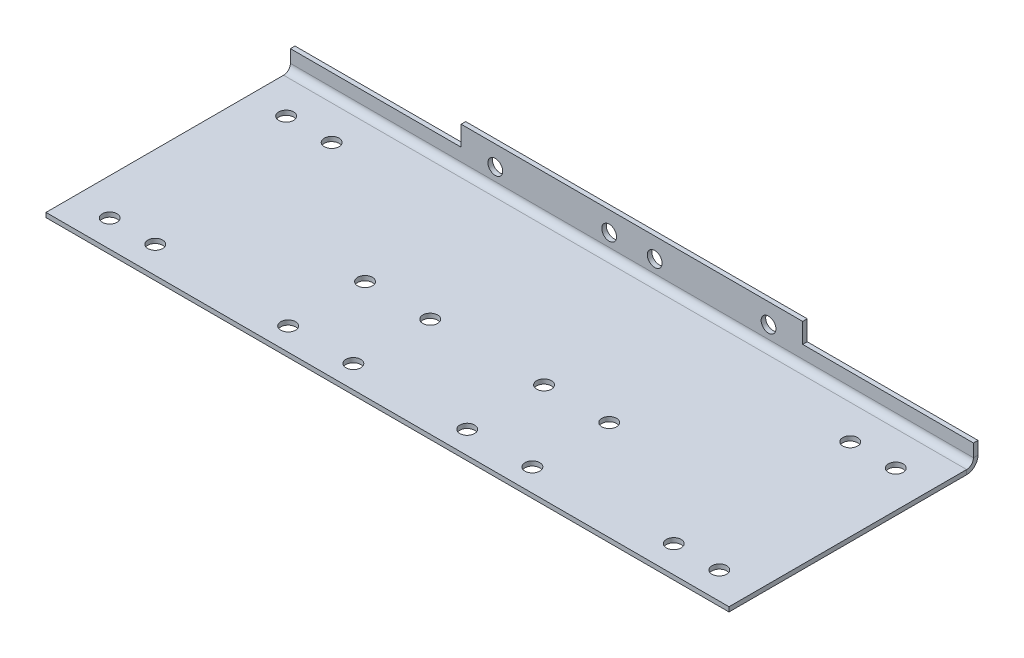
ISO-10303-21;
HEADER;
FILE_DESCRIPTION(('STEP AP214'),'2;1');
FILE_NAME('part.step','',(''),(''),'','','');
FILE_SCHEMA(('AUTOMOTIVE_DESIGN { 1 0 10303 214 1 1 1 1 }'));
ENDSEC;
DATA;
#1=APPLICATION_CONTEXT('core data for automotive mechanical design processes');
#2=APPLICATION_PROTOCOL_DEFINITION('international standard','automotive_design',2000,#1);
#3=PRODUCT_CONTEXT('',#1,'mechanical');
#4=PRODUCT('Part','Part','',(#3));
#5=PRODUCT_RELATED_PRODUCT_CATEGORY('part','',(#4));
#6=PRODUCT_DEFINITION_FORMATION('','',#4);
#7=PRODUCT_DEFINITION_CONTEXT('part definition',#1,'design');
#8=PRODUCT_DEFINITION('design','',#6,#7);
#9=PRODUCT_DEFINITION_SHAPE('','',#8);
#10=(LENGTH_UNIT() NAMED_UNIT(*) SI_UNIT(.MILLI.,.METRE.));
#11=(NAMED_UNIT(*) PLANE_ANGLE_UNIT() SI_UNIT($,.RADIAN.));
#12=(NAMED_UNIT(*) SI_UNIT($,.STERADIAN.) SOLID_ANGLE_UNIT());
#13=UNCERTAINTY_MEASURE_WITH_UNIT(LENGTH_MEASURE(1.E-05),#10,'distance_accuracy_value','');
#14=(GEOMETRIC_REPRESENTATION_CONTEXT(3) GLOBAL_UNCERTAINTY_ASSIGNED_CONTEXT((#13)) GLOBAL_UNIT_ASSIGNED_CONTEXT((#10,
#11,#12)) REPRESENTATION_CONTEXT('',''));
#15=CARTESIAN_POINT('',(0.,0.,0.));
#16=DIRECTION('',(0.,0.,1.));
#17=DIRECTION('',(1.,0.,0.));
#18=AXIS2_PLACEMENT_3D('',#15,#16,#17);
#19=CARTESIAN_POINT('',(0.,430.56637061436,429.433629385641));
#20=DIRECTION('',(0.,1.,0.));
#21=DIRECTION('',(1.,0.,0.));
#22=AXIS2_PLACEMENT_3D('',#19,#20,#21);
#23=PLANE('',#22);
#24=CARTESIAN_POINT('',(-500.000000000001,430.56637061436,254.433629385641));
#25=DIRECTION('',(0.,1.,0.));
#26=DIRECTION('',(0.,0.,1.));
#27=AXIS2_PLACEMENT_3D('',#24,#25,#26);
#28=CIRCLE('',#27,13.);
#29=CARTESIAN_POINT('',(-500.000000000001,430.56637061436,267.433629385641));
#30=VERTEX_POINT('',#29);
#31=EDGE_CURVE('E302',#30,#30,#28,.F.);
#32=ORIENTED_EDGE('',*,*,#31,.T.);
#33=EDGE_LOOP('',(#32));
#34=FACE_BOUND('',#33,.T.);
#35=CARTESIAN_POINT('',(-385.5,430.56637061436,254.43362938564));
#36=DIRECTION('',(0.,1.,0.));
#37=DIRECTION('',(0.,0.,1.));
#38=AXIS2_PLACEMENT_3D('',#35,#36,#37);
#39=CIRCLE('',#38,13.0000000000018);
#40=CARTESIAN_POINT('',(-385.5,430.56637061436,267.433629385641));
#41=VERTEX_POINT('',#40);
#42=EDGE_CURVE('E299',#41,#41,#39,.F.);
#43=ORIENTED_EDGE('',*,*,#42,.T.);
#44=EDGE_LOOP('',(#43));
#45=FACE_BOUND('',#44,.T.);
#46=CARTESIAN_POINT('',(-385.5,430.56637061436,389.43362938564));
#47=DIRECTION('',(0.,1.,0.));
#48=DIRECTION('',(0.,0.,1.));
#49=AXIS2_PLACEMENT_3D('',#46,#47,#48);
#50=CIRCLE('',#49,13.);
#51=CARTESIAN_POINT('',(-385.5,430.56637061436,402.43362938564));
#52=VERTEX_POINT('',#51);
#53=EDGE_CURVE('E296',#52,#52,#50,.F.);
#54=ORIENTED_EDGE('',*,*,#53,.T.);
#55=EDGE_LOOP('',(#54));
#56=FACE_BOUND('',#55,.T.);
#57=CARTESIAN_POINT('',(-500.,430.56637061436,389.433629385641));
#58=DIRECTION('',(0.,1.,0.));
#59=DIRECTION('',(0.,0.,1.));
#60=AXIS2_PLACEMENT_3D('',#57,#58,#59);
#61=CIRCLE('',#60,13.);
#62=CARTESIAN_POINT('',(-500.,430.56637061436,402.433629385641));
#63=VERTEX_POINT('',#62);
#64=EDGE_CURVE('E293',#63,#63,#61,.F.);
#65=ORIENTED_EDGE('',*,*,#64,.T.);
#66=EDGE_LOOP('',(#65));
#67=FACE_BOUND('',#66,.T.);
#68=CARTESIAN_POINT('',(-699.999999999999,430.56637061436,254.433629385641));
#69=DIRECTION('',(0.,1.,0.));
#70=DIRECTION('',(0.,0.,1.));
#71=AXIS2_PLACEMENT_3D('',#68,#69,#70);
#72=CIRCLE('',#71,13.);
#73=CARTESIAN_POINT('',(-699.999999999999,430.56637061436,267.433629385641));
#74=VERTEX_POINT('',#73);
#75=EDGE_CURVE('E326',#74,#74,#72,.T.);
#76=ORIENTED_EDGE('',*,*,#75,.F.);
#77=EDGE_LOOP('',(#76));
#78=FACE_BOUND('',#77,.T.);
#79=CARTESIAN_POINT('',(-814.5,430.56637061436,254.43362938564));
#80=DIRECTION('',(0.,1.,0.));
#81=DIRECTION('',(0.,0.,1.));
#82=AXIS2_PLACEMENT_3D('',#79,#80,#81);
#83=CIRCLE('',#82,13.0000000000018);
#84=CARTESIAN_POINT('',(-814.5,430.56637061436,267.433629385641));
#85=VERTEX_POINT('',#84);
#86=EDGE_CURVE('E323',#85,#85,#83,.T.);
#87=ORIENTED_EDGE('',*,*,#86,.F.);
#88=EDGE_LOOP('',(#87));
#89=FACE_BOUND('',#88,.T.);
#90=CARTESIAN_POINT('',(-814.5,430.56637061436,389.43362938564));
#91=DIRECTION('',(0.,1.,0.));
#92=DIRECTION('',(0.,0.,1.));
#93=AXIS2_PLACEMENT_3D('',#90,#91,#92);
#94=CIRCLE('',#93,13.);
#95=CARTESIAN_POINT('',(-814.5,430.56637061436,402.43362938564));
#96=VERTEX_POINT('',#95);
#97=EDGE_CURVE('E320',#96,#96,#94,.T.);
#98=ORIENTED_EDGE('',*,*,#97,.F.);
#99=EDGE_LOOP('',(#98));
#100=FACE_BOUND('',#99,.T.);
#101=CARTESIAN_POINT('',(-700.,430.56637061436,389.433629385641));
#102=DIRECTION('',(0.,1.,0.));
#103=DIRECTION('',(0.,0.,1.));
#104=AXIS2_PLACEMENT_3D('',#101,#102,#103);
#105=CIRCLE('',#104,13.);
#106=CARTESIAN_POINT('',(-700.,430.56637061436,402.433629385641));
#107=VERTEX_POINT('',#106);
#108=EDGE_CURVE('E317',#107,#107,#105,.T.);
#109=ORIENTED_EDGE('',*,*,#108,.F.);
#110=EDGE_LOOP('',(#109));
#111=FACE_BOUND('',#110,.T.);
#112=CARTESIAN_POINT('',(-64.4999999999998,430.566370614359,72.0000000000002));
#113=DIRECTION('',(0.,1.,0.));
#114=DIRECTION('',(0.,0.,1.));
#115=AXIS2_PLACEMENT_3D('',#112,#113,#114);
#116=CIRCLE('',#115,12.9999999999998);
#117=CARTESIAN_POINT('',(-64.4999999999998,430.566370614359,85.0000000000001));
#118=VERTEX_POINT('',#117);
#119=EDGE_CURVE('E366',#118,#118,#116,.F.);
#120=ORIENTED_EDGE('',*,*,#119,.T.);
#121=EDGE_LOOP('',(#120));
#122=FACE_BOUND('',#121,.T.);
#123=CARTESIAN_POINT('',(-64.4999999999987,430.56637061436,382.));
#124=DIRECTION('',(0.,1.,0.));
#125=DIRECTION('',(0.,0.,1.));
#126=AXIS2_PLACEMENT_3D('',#123,#124,#125);
#127=CIRCLE('',#126,12.9999999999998);
#128=CARTESIAN_POINT('',(-64.4999999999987,430.56637061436,395.));
#129=VERTEX_POINT('',#128);
#130=EDGE_CURVE('E360',#129,#129,#127,.F.);
#131=ORIENTED_EDGE('',*,*,#130,.T.);
#132=EDGE_LOOP('',(#131));
#133=FACE_BOUND('',#132,.T.);
#134=CARTESIAN_POINT('',(-1135.5,430.56637061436,382.));
#135=DIRECTION('',(0.,1.,0.));
#136=DIRECTION('',(0.,0.,1.));
#137=AXIS2_PLACEMENT_3D('',#134,#135,#136);
#138=CIRCLE('',#137,12.9999999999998);
#139=CARTESIAN_POINT('',(-1135.5,430.56637061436,395.));
#140=VERTEX_POINT('',#139);
#141=EDGE_CURVE('E357',#140,#140,#138,.T.);
#142=ORIENTED_EDGE('',*,*,#141,.F.);
#143=EDGE_LOOP('',(#142));
#144=FACE_BOUND('',#143,.T.);
#145=DIRECTION('',(0.,0.,-1.));
#146=VECTOR('',#145,1.);
#147=CARTESIAN_POINT('',(0.,430.56637061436,429.433629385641));
#148=LINE('',#147,#146);
#149=CARTESIAN_POINT('',(0.,430.56637061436,429.433629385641));
#150=VERTEX_POINT('',#149);
#151=CARTESIAN_POINT('',(0.,430.566370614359,12.));
#152=VERTEX_POINT('',#151);
#153=EDGE_CURVE('E71',#150,#152,#148,.T.);
#154=ORIENTED_EDGE('',*,*,#153,.T.);
#155=DIRECTION('',(-1.,0.,0.));
#156=VECTOR('',#155,1.);
#157=CARTESIAN_POINT('',(0.,430.566370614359,12.0000000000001));
#158=LINE('',#157,#156);
#159=CARTESIAN_POINT('',(-1200.,430.566370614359,12.));
#160=VERTEX_POINT('',#159);
#161=EDGE_CURVE('E63',#152,#160,#158,.T.);
#162=ORIENTED_EDGE('',*,*,#161,.T.);
#163=DIRECTION('',(0.,0.,1.));
#164=VECTOR('',#163,1.);
#165=CARTESIAN_POINT('',(-1200.,430.56637061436,429.433629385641));
#166=LINE('',#165,#164);
#167=CARTESIAN_POINT('',(-1200.,430.56637061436,429.433629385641));
#168=VERTEX_POINT('',#167);
#169=EDGE_CURVE('E78',#160,#168,#166,.T.);
#170=ORIENTED_EDGE('',*,*,#169,.T.);
#171=DIRECTION('',(1.,0.,0.));
#172=VECTOR('',#171,1.);
#173=CARTESIAN_POINT('',(0.,430.56637061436,429.433629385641));
#174=LINE('',#173,#172);
#175=EDGE_CURVE('E252',#168,#150,#174,.T.);
#176=ORIENTED_EDGE('',*,*,#175,.T.);
#177=EDGE_LOOP('',(#154,#162,#170,#176));
#178=FACE_BOUND('',#177,.T.);
#179=CARTESIAN_POINT('',(-144.5,430.566370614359,72.0000000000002));
#180=DIRECTION('',(0.,1.,0.));
#181=DIRECTION('',(0.,0.,1.));
#182=AXIS2_PLACEMENT_3D('',#179,#180,#181);
#183=CIRCLE('',#182,12.9999999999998);
#184=CARTESIAN_POINT('',(-144.5,430.566370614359,85.));
#185=VERTEX_POINT('',#184);
#186=EDGE_CURVE('E363',#185,#185,#183,.F.);
#187=ORIENTED_EDGE('',*,*,#186,.T.);
#188=EDGE_LOOP('',(#187));
#189=FACE_BOUND('',#188,.T.);
#190=CARTESIAN_POINT('',(-1055.5,430.56637061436,382.));
#191=DIRECTION('',(0.,1.,0.));
#192=DIRECTION('',(0.,0.,1.));
#193=AXIS2_PLACEMENT_3D('',#190,#191,#192);
#194=CIRCLE('',#193,12.9999999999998);
#195=CARTESIAN_POINT('',(-1055.5,430.56637061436,395.));
#196=VERTEX_POINT('',#195);
#197=EDGE_CURVE('E369',#196,#196,#194,.T.);
#198=ORIENTED_EDGE('',*,*,#197,.F.);
#199=EDGE_LOOP('',(#198));
#200=FACE_BOUND('',#199,.T.);
#201=CARTESIAN_POINT('',(-1055.5,430.566370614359,72.0000000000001));
#202=DIRECTION('',(0.,1.,0.));
#203=DIRECTION('',(0.,0.,1.));
#204=AXIS2_PLACEMENT_3D('',#201,#202,#203);
#205=CIRCLE('',#204,12.9999999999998);
#206=CARTESIAN_POINT('',(-1055.5,430.566370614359,84.9999999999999));
#207=VERTEX_POINT('',#206);
#208=EDGE_CURVE('E372',#207,#207,#205,.T.);
#209=ORIENTED_EDGE('',*,*,#208,.F.);
#210=EDGE_LOOP('',(#209));
#211=FACE_BOUND('',#210,.T.);
#212=CARTESIAN_POINT('',(-1135.5,430.566370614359,72.0000000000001));
#213=DIRECTION('',(0.,1.,0.));
#214=DIRECTION('',(0.,0.,1.));
#215=AXIS2_PLACEMENT_3D('',#212,#213,#214);
#216=CIRCLE('',#215,12.9999999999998);
#217=CARTESIAN_POINT('',(-1135.5,430.566370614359,84.9999999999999));
#218=VERTEX_POINT('',#217);
#219=EDGE_CURVE('E375',#218,#218,#216,.T.);
#220=ORIENTED_EDGE('',*,*,#219,.F.);
#221=EDGE_LOOP('',(#220));
#222=FACE_BOUND('',#221,.T.);
#223=CARTESIAN_POINT('',(-144.499999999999,430.56637061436,382.));
#224=DIRECTION('',(0.,1.,0.));
#225=DIRECTION('',(0.,0.,1.));
#226=AXIS2_PLACEMENT_3D('',#223,#224,#225);
#227=CIRCLE('',#226,12.9999999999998);
#228=CARTESIAN_POINT('',(-144.499999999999,430.56637061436,395.));
#229=VERTEX_POINT('',#228);
#230=EDGE_CURVE('E192',#229,#229,#227,.F.);
#231=ORIENTED_EDGE('',*,*,#230,.T.);
#232=EDGE_LOOP('',(#231));
#233=FACE_BOUND('',#232,.T.);
#234=ADVANCED_FACE('F54',(#34,#45,#56,#67,#78,#89,#100,#111,#122,#133,#144,#178,#189,#200,#211,
#222,#233),#23,.T.);
#235=CARTESIAN_POINT('',(0.,422.56637061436,429.433629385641));
#236=DIRECTION('',(0.,1.,0.));
#237=DIRECTION('',(1.,0.,0.));
#238=AXIS2_PLACEMENT_3D('',#235,#236,#237);
#239=PLANE('',#238);
#240=CARTESIAN_POINT('',(-500.000000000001,422.56637061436,254.433629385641));
#241=DIRECTION('',(0.,1.,0.));
#242=DIRECTION('',(0.,0.,-1.));
#243=AXIS2_PLACEMENT_3D('',#240,#241,#242);
#244=CIRCLE('',#243,13.);
#245=CARTESIAN_POINT('',(-500.000000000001,422.56637061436,241.433629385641));
#246=VERTEX_POINT('',#245);
#247=EDGE_CURVE('E273',#246,#246,#244,.T.);
#248=ORIENTED_EDGE('',*,*,#247,.T.);
#249=EDGE_LOOP('',(#248));
#250=FACE_BOUND('',#249,.T.);
#251=CARTESIAN_POINT('',(-385.5,422.56637061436,254.43362938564));
#252=DIRECTION('',(0.,1.,0.));
#253=DIRECTION('',(0.,0.,-1.));
#254=AXIS2_PLACEMENT_3D('',#251,#252,#253);
#255=CIRCLE('',#254,13.0000000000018);
#256=CARTESIAN_POINT('',(-385.5,422.56637061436,241.433629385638));
#257=VERTEX_POINT('',#256);
#258=EDGE_CURVE('E286',#257,#257,#255,.T.);
#259=ORIENTED_EDGE('',*,*,#258,.T.);
#260=EDGE_LOOP('',(#259));
#261=FACE_BOUND('',#260,.T.);
#262=CARTESIAN_POINT('',(-385.5,422.56637061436,389.43362938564));
#263=DIRECTION('',(0.,1.,0.));
#264=DIRECTION('',(0.,0.,-1.));
#265=AXIS2_PLACEMENT_3D('',#262,#263,#264);
#266=CIRCLE('',#265,13.);
#267=CARTESIAN_POINT('',(-385.5,422.56637061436,376.43362938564));
#268=VERTEX_POINT('',#267);
#269=EDGE_CURVE('E282',#268,#268,#266,.T.);
#270=ORIENTED_EDGE('',*,*,#269,.T.);
#271=EDGE_LOOP('',(#270));
#272=FACE_BOUND('',#271,.T.);
#273=CARTESIAN_POINT('',(-500.,422.56637061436,389.433629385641));
#274=DIRECTION('',(0.,1.,0.));
#275=DIRECTION('',(0.,0.,-1.));
#276=AXIS2_PLACEMENT_3D('',#273,#274,#275);
#277=CIRCLE('',#276,13.);
#278=CARTESIAN_POINT('',(-500.,422.56637061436,376.433629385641));
#279=VERTEX_POINT('',#278);
#280=EDGE_CURVE('E285',#279,#279,#277,.T.);
#281=ORIENTED_EDGE('',*,*,#280,.T.);
#282=EDGE_LOOP('',(#281));
#283=FACE_BOUND('',#282,.T.);
#284=CARTESIAN_POINT('',(-699.999999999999,422.56637061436,254.433629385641));
#285=DIRECTION('',(0.,-1.,0.));
#286=DIRECTION('',(0.,0.,-1.));
#287=AXIS2_PLACEMENT_3D('',#284,#285,#286);
#288=CIRCLE('',#287,13.);
#289=CARTESIAN_POINT('',(-699.999999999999,422.56637061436,241.433629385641));
#290=VERTEX_POINT('',#289);
#291=EDGE_CURVE('E305',#290,#290,#288,.T.);
#292=ORIENTED_EDGE('',*,*,#291,.F.);
#293=EDGE_LOOP('',(#292));
#294=FACE_BOUND('',#293,.T.);
#295=CARTESIAN_POINT('',(-814.5,422.56637061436,254.43362938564));
#296=DIRECTION('',(0.,-1.,0.));
#297=DIRECTION('',(0.,0.,-1.));
#298=AXIS2_PLACEMENT_3D('',#295,#296,#297);
#299=CIRCLE('',#298,13.0000000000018);
#300=CARTESIAN_POINT('',(-814.5,422.56637061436,241.433629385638));
#301=VERTEX_POINT('',#300);
#302=EDGE_CURVE('E310',#301,#301,#299,.T.);
#303=ORIENTED_EDGE('',*,*,#302,.F.);
#304=EDGE_LOOP('',(#303));
#305=FACE_BOUND('',#304,.T.);
#306=CARTESIAN_POINT('',(-814.5,422.56637061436,389.43362938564));
#307=DIRECTION('',(0.,-1.,0.));
#308=DIRECTION('',(0.,0.,-1.));
#309=AXIS2_PLACEMENT_3D('',#306,#307,#308);
#310=CIRCLE('',#309,13.);
#311=CARTESIAN_POINT('',(-814.5,422.56637061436,376.43362938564));
#312=VERTEX_POINT('',#311);
#313=EDGE_CURVE('E306',#312,#312,#310,.T.);
#314=ORIENTED_EDGE('',*,*,#313,.F.);
#315=EDGE_LOOP('',(#314));
#316=FACE_BOUND('',#315,.T.);
#317=CARTESIAN_POINT('',(-700.,422.56637061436,389.433629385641));
#318=DIRECTION('',(0.,-1.,0.));
#319=DIRECTION('',(0.,0.,-1.));
#320=AXIS2_PLACEMENT_3D('',#317,#318,#319);
#321=CIRCLE('',#320,13.);
#322=CARTESIAN_POINT('',(-700.,422.56637061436,376.433629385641));
#323=VERTEX_POINT('',#322);
#324=EDGE_CURVE('E309',#323,#323,#321,.T.);
#325=ORIENTED_EDGE('',*,*,#324,.F.);
#326=EDGE_LOOP('',(#325));
#327=FACE_BOUND('',#326,.T.);
#328=CARTESIAN_POINT('',(-1135.5,422.566370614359,72.0000000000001));
#329=DIRECTION('',(0.,-1.,0.));
#330=DIRECTION('',(0.,0.,-1.));
#331=AXIS2_PLACEMENT_3D('',#328,#329,#330);
#332=CIRCLE('',#331,12.9999999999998);
#333=CARTESIAN_POINT('',(-1135.5,422.566370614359,59.0000000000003));
#334=VERTEX_POINT('',#333);
#335=EDGE_CURVE('E343',#334,#334,#332,.T.);
#336=ORIENTED_EDGE('',*,*,#335,.F.);
#337=EDGE_LOOP('',(#336));
#338=FACE_BOUND('',#337,.T.);
#339=CARTESIAN_POINT('',(-1055.5,422.566370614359,72.0000000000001));
#340=DIRECTION('',(0.,-1.,0.));
#341=DIRECTION('',(0.,0.,-1.));
#342=AXIS2_PLACEMENT_3D('',#339,#340,#341);
#343=CIRCLE('',#342,12.9999999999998);
#344=CARTESIAN_POINT('',(-1055.5,422.566370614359,59.0000000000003));
#345=VERTEX_POINT('',#344);
#346=EDGE_CURVE('E346',#345,#345,#343,.T.);
#347=ORIENTED_EDGE('',*,*,#346,.F.);
#348=EDGE_LOOP('',(#347));
#349=FACE_BOUND('',#348,.T.);
#350=CARTESIAN_POINT('',(-1055.5,422.56637061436,382.));
#351=DIRECTION('',(0.,-1.,0.));
#352=DIRECTION('',(0.,0.,-1.));
#353=AXIS2_PLACEMENT_3D('',#350,#351,#352);
#354=CIRCLE('',#353,12.9999999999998);
#355=CARTESIAN_POINT('',(-1055.5,422.56637061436,369.));
#356=VERTEX_POINT('',#355);
#357=EDGE_CURVE('E349',#356,#356,#354,.T.);
#358=ORIENTED_EDGE('',*,*,#357,.F.);
#359=EDGE_LOOP('',(#358));
#360=FACE_BOUND('',#359,.T.);
#361=CARTESIAN_POINT('',(-1135.5,422.56637061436,382.));
#362=DIRECTION('',(0.,-1.,0.));
#363=DIRECTION('',(0.,0.,-1.));
#364=AXIS2_PLACEMENT_3D('',#361,#362,#363);
#365=CIRCLE('',#364,12.9999999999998);
#366=CARTESIAN_POINT('',(-1135.5,422.56637061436,369.));
#367=VERTEX_POINT('',#366);
#368=EDGE_CURVE('E352',#367,#367,#365,.T.);
#369=ORIENTED_EDGE('',*,*,#368,.F.);
#370=EDGE_LOOP('',(#369));
#371=FACE_BOUND('',#370,.T.);
#372=DIRECTION('',(-1.,0.,0.));
#373=VECTOR('',#372,1.);
#374=CARTESIAN_POINT('',(0.,422.566370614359,12.0000000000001));
#375=LINE('',#374,#373);
#376=CARTESIAN_POINT('',(0.,422.566370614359,12.0000000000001));
#377=VERTEX_POINT('',#376);
#378=CARTESIAN_POINT('',(-1200.,422.566370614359,12.0000000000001));
#379=VERTEX_POINT('',#378);
#380=EDGE_CURVE('E152',#377,#379,#375,.T.);
#381=ORIENTED_EDGE('',*,*,#380,.F.);
#382=DIRECTION('',(0.,0.,-1.));
#383=VECTOR('',#382,1.);
#384=CARTESIAN_POINT('',(0.,422.56637061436,429.433629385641));
#385=LINE('',#384,#383);
#386=CARTESIAN_POINT('',(0.,422.56637061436,429.433629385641));
#387=VERTEX_POINT('',#386);
#388=EDGE_CURVE('E163',#387,#377,#385,.T.);
#389=ORIENTED_EDGE('',*,*,#388,.F.);
#390=DIRECTION('',(1.,0.,0.));
#391=VECTOR('',#390,1.);
#392=CARTESIAN_POINT('',(0.,422.56637061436,429.433629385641));
#393=LINE('',#392,#391);
#394=CARTESIAN_POINT('',(-1200.,422.56637061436,429.433629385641));
#395=VERTEX_POINT('',#394);
#396=EDGE_CURVE('E162',#395,#387,#393,.T.);
#397=ORIENTED_EDGE('',*,*,#396,.F.);
#398=DIRECTION('',(0.,0.,1.));
#399=VECTOR('',#398,1.);
#400=CARTESIAN_POINT('',(-1200.,422.56637061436,429.433629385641));
#401=LINE('',#400,#399);
#402=EDGE_CURVE('E146',#379,#395,#401,.T.);
#403=ORIENTED_EDGE('',*,*,#402,.F.);
#404=EDGE_LOOP('',(#381,#389,#397,#403));
#405=FACE_BOUND('',#404,.T.);
#406=CARTESIAN_POINT('',(-64.4999999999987,422.56637061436,382.));
#407=DIRECTION('',(0.,1.,0.));
#408=DIRECTION('',(0.,0.,1.));
#409=AXIS2_PLACEMENT_3D('',#406,#407,#408);
#410=CIRCLE('',#409,12.9999999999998);
#411=CARTESIAN_POINT('',(-64.4999999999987,422.56637061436,395.));
#412=VERTEX_POINT('',#411);
#413=EDGE_CURVE('E337',#412,#412,#410,.T.);
#414=ORIENTED_EDGE('',*,*,#413,.T.);
#415=EDGE_LOOP('',(#414));
#416=FACE_BOUND('',#415,.T.);
#417=CARTESIAN_POINT('',(-144.5,422.566370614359,72.0000000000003));
#418=DIRECTION('',(0.,1.,0.));
#419=DIRECTION('',(0.,0.,1.));
#420=AXIS2_PLACEMENT_3D('',#417,#418,#419);
#421=CIRCLE('',#420,12.9999999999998);
#422=CARTESIAN_POINT('',(-144.5,422.566370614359,85.0000000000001));
#423=VERTEX_POINT('',#422);
#424=EDGE_CURVE('E336',#423,#423,#421,.T.);
#425=ORIENTED_EDGE('',*,*,#424,.T.);
#426=EDGE_LOOP('',(#425));
#427=FACE_BOUND('',#426,.T.);
#428=CARTESIAN_POINT('',(-64.4999999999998,422.566370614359,72.0000000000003));
#429=DIRECTION('',(0.,1.,0.));
#430=DIRECTION('',(0.,0.,1.));
#431=AXIS2_PLACEMENT_3D('',#428,#429,#430);
#432=CIRCLE('',#431,12.9999999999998);
#433=CARTESIAN_POINT('',(-64.4999999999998,422.566370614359,85.0000000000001));
#434=VERTEX_POINT('',#433);
#435=EDGE_CURVE('E266',#434,#434,#432,.T.);
#436=ORIENTED_EDGE('',*,*,#435,.T.);
#437=EDGE_LOOP('',(#436));
#438=FACE_BOUND('',#437,.T.);
#439=CARTESIAN_POINT('',(-144.499999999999,422.56637061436,382.));
#440=DIRECTION('',(0.,1.,0.));
#441=DIRECTION('',(0.,0.,1.));
#442=AXIS2_PLACEMENT_3D('',#439,#440,#441);
#443=CIRCLE('',#442,12.9999999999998);
#444=CARTESIAN_POINT('',(-144.499999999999,422.56637061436,395.));
#445=VERTEX_POINT('',#444);
#446=EDGE_CURVE('E340',#445,#445,#443,.T.);
#447=ORIENTED_EDGE('',*,*,#446,.T.);
#448=EDGE_LOOP('',(#447));
#449=FACE_BOUND('',#448,.T.);
#450=ADVANCED_FACE('F157',(#250,#261,#272,#283,#294,#305,#316,#327,#338,#349,#360,#371,#405,
#416,#427,#438,#449),#239,.F.);
#451=CARTESIAN_POINT('',(0.,422.56637061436,429.433629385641));
#452=DIRECTION('',(1.,0.,0.));
#453=DIRECTION('',(0.,-1.,0.));
#454=AXIS2_PLACEMENT_3D('',#451,#452,#453);
#455=PLANE('',#454);
#456=ORIENTED_EDGE('',*,*,#388,.T.);
#457=DIRECTION('',(0.,1.,0.));
#458=VECTOR('',#457,1.);
#459=CARTESIAN_POINT('',(0.,422.566370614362,12.0000000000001));
#460=LINE('',#459,#458);
#461=EDGE_CURVE('E14',#377,#152,#460,.T.);
#462=ORIENTED_EDGE('',*,*,#461,.T.);
#463=ORIENTED_EDGE('',*,*,#153,.F.);
#464=DIRECTION('',(0.,1.,0.));
#465=VECTOR('',#464,1.);
#466=CARTESIAN_POINT('',(0.,422.56637061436,429.433629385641));
#467=LINE('',#466,#465);
#468=EDGE_CURVE('E173',#387,#150,#467,.T.);
#469=ORIENTED_EDGE('',*,*,#468,.F.);
#470=EDGE_LOOP('',(#456,#462,#463,#469));
#471=FACE_BOUND('',#470,.T.);
#472=ADVANCED_FACE('F56',(#471),#455,.T.);
#473=CARTESIAN_POINT('',(-1200.,422.56637061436,429.433629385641));
#474=DIRECTION('',(-1.,0.,0.));
#475=DIRECTION('',(0.,1.,0.));
#476=AXIS2_PLACEMENT_3D('',#473,#474,#475);
#477=PLANE('',#476);
#478=ORIENTED_EDGE('',*,*,#169,.F.);
#479=DIRECTION('',(0.,-1.,0.));
#480=VECTOR('',#479,1.);
#481=CARTESIAN_POINT('',(-1200.,422.566370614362,12.0000000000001));
#482=LINE('',#481,#480);
#483=EDGE_CURVE('E143',#160,#379,#482,.T.);
#484=ORIENTED_EDGE('',*,*,#483,.T.);
#485=ORIENTED_EDGE('',*,*,#402,.T.);
#486=DIRECTION('',(0.,1.,0.));
#487=VECTOR('',#486,1.);
#488=CARTESIAN_POINT('',(-1200.,422.56637061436,429.433629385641));
#489=LINE('',#488,#487);
#490=EDGE_CURVE('E251',#395,#168,#489,.T.);
#491=ORIENTED_EDGE('',*,*,#490,.T.);
#492=EDGE_LOOP('',(#478,#484,#485,#491));
#493=FACE_BOUND('',#492,.T.);
#494=ADVANCED_FACE('F145',(#493),#477,.T.);
#495=CARTESIAN_POINT('',(0.,422.56637061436,429.433629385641));
#496=DIRECTION('',(0.,0.,1.));
#497=DIRECTION('',(0.,-1.,0.));
#498=AXIS2_PLACEMENT_3D('',#495,#496,#497);
#499=PLANE('',#498);
#500=ORIENTED_EDGE('',*,*,#175,.F.);
#501=ORIENTED_EDGE('',*,*,#490,.F.);
#502=ORIENTED_EDGE('',*,*,#396,.T.);
#503=ORIENTED_EDGE('',*,*,#468,.T.);
#504=EDGE_LOOP('',(#500,#501,#502,#503));
#505=FACE_BOUND('',#504,.T.);
#506=ADVANCED_FACE('F401',(#505),#499,.T.);
#507=CARTESIAN_POINT('',(0.,465.,-8.));
#508=DIRECTION('',(0.,1.,0.));
#509=DIRECTION('',(-1.,0.,0.));
#510=AXIS2_PLACEMENT_3D('',#507,#508,#509);
#511=PLANE('',#510);
#512=DIRECTION('',(-1.,0.,0.));
#513=VECTOR('',#512,1.);
#514=CARTESIAN_POINT('',(0.,465.,0.));
#515=LINE('',#514,#513);
#516=CARTESIAN_POINT('',(0.,465.,0.));
#517=VERTEX_POINT('',#516);
#518=CARTESIAN_POINT('',(-300.,465.,0.));
#519=VERTEX_POINT('',#518);
#520=EDGE_CURVE('E212',#517,#519,#515,.T.);
#521=ORIENTED_EDGE('',*,*,#520,.F.);
#522=DIRECTION('',(0.,0.,1.));
#523=VECTOR('',#522,1.);
#524=CARTESIAN_POINT('',(0.,465.,-8.));
#525=LINE('',#524,#523);
#526=CARTESIAN_POINT('',(0.,465.,-8.));
#527=VERTEX_POINT('',#526);
#528=EDGE_CURVE('E193',#527,#517,#525,.T.);
#529=ORIENTED_EDGE('',*,*,#528,.F.);
#530=DIRECTION('',(-1.,0.,0.));
#531=VECTOR('',#530,1.);
#532=CARTESIAN_POINT('',(0.,465.,-8.));
#533=LINE('',#532,#531);
#534=CARTESIAN_POINT('',(-300.,465.,-8.));
#535=VERTEX_POINT('',#534);
#536=EDGE_CURVE('E244',#527,#535,#533,.T.);
#537=ORIENTED_EDGE('',*,*,#536,.T.);
#538=DIRECTION('',(0.,0.,1.));
#539=VECTOR('',#538,1.);
#540=CARTESIAN_POINT('',(-300.,465.,-8.));
#541=LINE('',#540,#539);
#542=EDGE_CURVE('E242',#535,#519,#541,.T.);
#543=ORIENTED_EDGE('',*,*,#542,.T.);
#544=EDGE_LOOP('',(#521,#529,#537,#543));
#545=FACE_BOUND('',#544,.T.);
#546=ADVANCED_FACE('F407',(#545),#511,.T.);
#547=CARTESIAN_POINT('',(-300.,500.,-8.));
#548=DIRECTION('',(1.,0.,0.));
#549=DIRECTION('',(0.,1.,0.));
#550=AXIS2_PLACEMENT_3D('',#547,#548,#549);
#551=PLANE('',#550);
#552=DIRECTION('',(0.,1.,0.));
#553=VECTOR('',#552,1.);
#554=CARTESIAN_POINT('',(-300.,500.,0.));
#555=LINE('',#554,#553);
#556=CARTESIAN_POINT('',(-300.,500.,0.));
#557=VERTEX_POINT('',#556);
#558=EDGE_CURVE('E209',#519,#557,#555,.T.);
#559=ORIENTED_EDGE('',*,*,#558,.F.);
#560=ORIENTED_EDGE('',*,*,#542,.F.);
#561=DIRECTION('',(0.,1.,0.));
#562=VECTOR('',#561,1.);
#563=CARTESIAN_POINT('',(-300.,500.,-8.));
#564=LINE('',#563,#562);
#565=CARTESIAN_POINT('',(-300.,500.,-8.));
#566=VERTEX_POINT('',#565);
#567=EDGE_CURVE('E239',#535,#566,#564,.T.);
#568=ORIENTED_EDGE('',*,*,#567,.T.);
#569=DIRECTION('',(0.,0.,1.));
#570=VECTOR('',#569,1.);
#571=CARTESIAN_POINT('',(-300.,500.,-8.));
#572=LINE('',#571,#570);
#573=EDGE_CURVE('E237',#566,#557,#572,.T.);
#574=ORIENTED_EDGE('',*,*,#573,.T.);
#575=EDGE_LOOP('',(#559,#560,#568,#574));
#576=FACE_BOUND('',#575,.T.);
#577=ADVANCED_FACE('F412',(#576),#551,.T.);
#578=CARTESIAN_POINT('',(-900.,500.,-8.));
#579=DIRECTION('',(0.,1.,0.));
#580=DIRECTION('',(0.,0.,1.));
#581=AXIS2_PLACEMENT_3D('',#578,#579,#580);
#582=PLANE('',#581);
#583=DIRECTION('',(-1.,0.,0.));
#584=VECTOR('',#583,1.);
#585=CARTESIAN_POINT('',(-900.,500.,0.));
#586=LINE('',#585,#584);
#587=CARTESIAN_POINT('',(-900.,500.,0.));
#588=VERTEX_POINT('',#587);
#589=EDGE_CURVE('E206',#557,#588,#586,.T.);
#590=ORIENTED_EDGE('',*,*,#589,.F.);
#591=ORIENTED_EDGE('',*,*,#573,.F.);
#592=DIRECTION('',(-1.,0.,0.));
#593=VECTOR('',#592,1.);
#594=CARTESIAN_POINT('',(-900.,500.,-8.));
#595=LINE('',#594,#593);
#596=CARTESIAN_POINT('',(-900.,500.,-8.));
#597=VERTEX_POINT('',#596);
#598=EDGE_CURVE('E234',#566,#597,#595,.T.);
#599=ORIENTED_EDGE('',*,*,#598,.T.);
#600=DIRECTION('',(0.,0.,1.));
#601=VECTOR('',#600,1.);
#602=CARTESIAN_POINT('',(-900.,500.,-8.));
#603=LINE('',#602,#601);
#604=EDGE_CURVE('E232',#597,#588,#603,.T.);
#605=ORIENTED_EDGE('',*,*,#604,.T.);
#606=EDGE_LOOP('',(#590,#591,#599,#605));
#607=FACE_BOUND('',#606,.T.);
#608=ADVANCED_FACE('F447',(#607),#582,.T.);
#609=CARTESIAN_POINT('',(-900.,465.,-8.));
#610=DIRECTION('',(-1.,0.,0.));
#611=DIRECTION('',(0.,0.,1.));
#612=AXIS2_PLACEMENT_3D('',#609,#610,#611);
#613=PLANE('',#612);
#614=DIRECTION('',(0.,-1.,0.));
#615=VECTOR('',#614,1.);
#616=CARTESIAN_POINT('',(-900.,465.,0.));
#617=LINE('',#616,#615);
#618=CARTESIAN_POINT('',(-900.,465.,0.));
#619=VERTEX_POINT('',#618);
#620=EDGE_CURVE('E203',#588,#619,#617,.T.);
#621=ORIENTED_EDGE('',*,*,#620,.F.);
#622=ORIENTED_EDGE('',*,*,#604,.F.);
#623=DIRECTION('',(0.,-1.,0.));
#624=VECTOR('',#623,1.);
#625=CARTESIAN_POINT('',(-900.,465.,-8.));
#626=LINE('',#625,#624);
#627=CARTESIAN_POINT('',(-900.,465.,-8.));
#628=VERTEX_POINT('',#627);
#629=EDGE_CURVE('E229',#597,#628,#626,.T.);
#630=ORIENTED_EDGE('',*,*,#629,.T.);
#631=DIRECTION('',(0.,0.,1.));
#632=VECTOR('',#631,1.);
#633=CARTESIAN_POINT('',(-900.,465.,-8.));
#634=LINE('',#633,#632);
#635=EDGE_CURVE('E227',#628,#619,#634,.T.);
#636=ORIENTED_EDGE('',*,*,#635,.T.);
#637=EDGE_LOOP('',(#621,#622,#630,#636));
#638=FACE_BOUND('',#637,.T.);
#639=ADVANCED_FACE('F451',(#638),#613,.T.);
#640=CARTESIAN_POINT('',(-900.,465.,-8.));
#641=DIRECTION('',(0.,1.,0.));
#642=DIRECTION('',(0.,0.,1.));
#643=AXIS2_PLACEMENT_3D('',#640,#641,#642);
#644=PLANE('',#643);
#645=DIRECTION('',(-1.,0.,0.));
#646=VECTOR('',#645,1.);
#647=CARTESIAN_POINT('',(-900.,465.,0.));
#648=LINE('',#647,#646);
#649=CARTESIAN_POINT('',(-1200.,465.,0.));
#650=VERTEX_POINT('',#649);
#651=EDGE_CURVE('E200',#619,#650,#648,.T.);
#652=ORIENTED_EDGE('',*,*,#651,.F.);
#653=ORIENTED_EDGE('',*,*,#635,.F.);
#654=DIRECTION('',(-1.,0.,0.));
#655=VECTOR('',#654,1.);
#656=CARTESIAN_POINT('',(-900.,465.,-8.));
#657=LINE('',#656,#655);
#658=CARTESIAN_POINT('',(-1200.,465.,-8.));
#659=VERTEX_POINT('',#658);
#660=EDGE_CURVE('E224',#628,#659,#657,.T.);
#661=ORIENTED_EDGE('',*,*,#660,.T.);
#662=DIRECTION('',(0.,0.,1.));
#663=VECTOR('',#662,1.);
#664=CARTESIAN_POINT('',(-1200.,465.,-8.));
#665=LINE('',#664,#663);
#666=EDGE_CURVE('E222',#659,#650,#665,.T.);
#667=ORIENTED_EDGE('',*,*,#666,.T.);
#668=EDGE_LOOP('',(#652,#653,#661,#667));
#669=FACE_BOUND('',#668,.T.);
#670=ADVANCED_FACE('F453',(#669),#644,.T.);
#671=CARTESIAN_POINT('',(0.,0.,-8.));
#672=DIRECTION('',(0.,0.,1.));
#673=DIRECTION('',(1.,0.,0.));
#674=AXIS2_PLACEMENT_3D('',#671,#672,#673);
#675=PLANE('',#674);
#676=CARTESIAN_POINT('',(-840.,465.,-8.));
#677=DIRECTION('',(0.,0.,-1.));
#678=DIRECTION('',(-1.,0.,0.));
#679=AXIS2_PLACEMENT_3D('',#676,#677,#678);
#680=CIRCLE('',#679,13.);
#681=CARTESIAN_POINT('',(-853.,465.,-8.));
#682=VERTEX_POINT('',#681);
#683=EDGE_CURVE('E269',#682,#682,#680,.T.);
#684=ORIENTED_EDGE('',*,*,#683,.F.);
#685=EDGE_LOOP('',(#684));
#686=FACE_BOUND('',#685,.T.);
#687=CARTESIAN_POINT('',(-360.,465.,-8.));
#688=DIRECTION('',(0.,0.,-1.));
#689=DIRECTION('',(-1.,0.,0.));
#690=AXIS2_PLACEMENT_3D('',#687,#688,#689);
#691=CIRCLE('',#690,13.);
#692=CARTESIAN_POINT('',(-373.,465.,-8.));
#693=VERTEX_POINT('',#692);
#694=EDGE_CURVE('E275',#693,#693,#691,.T.);
#695=ORIENTED_EDGE('',*,*,#694,.F.);
#696=EDGE_LOOP('',(#695));
#697=FACE_BOUND('',#696,.T.);
#698=CARTESIAN_POINT('',(-640.,465.,-8.));
#699=DIRECTION('',(0.,0.,-1.));
#700=DIRECTION('',(-1.,0.,0.));
#701=AXIS2_PLACEMENT_3D('',#698,#699,#700);
#702=CIRCLE('',#701,13.);
#703=CARTESIAN_POINT('',(-653.,465.,-8.));
#704=VERTEX_POINT('',#703);
#705=EDGE_CURVE('E264',#704,#704,#702,.T.);
#706=ORIENTED_EDGE('',*,*,#705,.F.);
#707=EDGE_LOOP('',(#706));
#708=FACE_BOUND('',#707,.T.);
#709=CARTESIAN_POINT('',(-560.,465.,-8.));
#710=DIRECTION('',(0.,0.,-1.));
#711=DIRECTION('',(-1.,0.,0.));
#712=AXIS2_PLACEMENT_3D('',#709,#710,#711);
#713=CIRCLE('',#712,13.);
#714=CARTESIAN_POINT('',(-573.,465.,-8.));
#715=VERTEX_POINT('',#714);
#716=EDGE_CURVE('E329',#715,#715,#713,.T.);
#717=ORIENTED_EDGE('',*,*,#716,.F.);
#718=EDGE_LOOP('',(#717));
#719=FACE_BOUND('',#718,.T.);
#720=DIRECTION('',(0.,1.,0.));
#721=VECTOR('',#720,1.);
#722=CARTESIAN_POINT('',(0.,0.,-8.));
#723=LINE('',#722,#721);
#724=CARTESIAN_POINT('',(0.,442.566370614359,-8.));
#725=VERTEX_POINT('',#724);
#726=EDGE_CURVE('E196',#725,#527,#723,.T.);
#727=ORIENTED_EDGE('',*,*,#726,.F.);
#728=DIRECTION('',(-1.,0.,0.));
#729=VECTOR('',#728,1.);
#730=CARTESIAN_POINT('',(0.,442.566370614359,-8.));
#731=LINE('',#730,#729);
#732=CARTESIAN_POINT('',(-1200.,442.566370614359,-8.00000000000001));
#733=VERTEX_POINT('',#732);
#734=EDGE_CURVE('E219',#725,#733,#731,.T.);
#735=ORIENTED_EDGE('',*,*,#734,.T.);
#736=DIRECTION('',(0.,-1.,0.));
#737=VECTOR('',#736,1.);
#738=CARTESIAN_POINT('',(-1200.,0.,-8.));
#739=LINE('',#738,#737);
#740=EDGE_CURVE('E217',#659,#733,#739,.T.);
#741=ORIENTED_EDGE('',*,*,#740,.F.);
#742=ORIENTED_EDGE('',*,*,#660,.F.);
#743=ORIENTED_EDGE('',*,*,#629,.F.);
#744=ORIENTED_EDGE('',*,*,#598,.F.);
#745=ORIENTED_EDGE('',*,*,#567,.F.);
#746=ORIENTED_EDGE('',*,*,#536,.F.);
#747=EDGE_LOOP('',(#727,#735,#741,#742,#743,#744,#745,#746));
#748=FACE_BOUND('',#747,.T.);
#749=ADVANCED_FACE('F439',(#686,#697,#708,#719,#748),#675,.F.);
#750=CARTESIAN_POINT('',(-1200.,0.,-8.));
#751=DIRECTION('',(-1.,0.,0.));
#752=DIRECTION('',(0.,0.,1.));
#753=AXIS2_PLACEMENT_3D('',#750,#751,#752);
#754=PLANE('',#753);
#755=DIRECTION('',(0.,0.,-1.));
#756=VECTOR('',#755,1.);
#757=CARTESIAN_POINT('',(-1200.,442.566370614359,-7.99999999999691));
#758=LINE('',#757,#756);
#759=CARTESIAN_POINT('',(-1200.,442.566370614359,0.));
#760=VERTEX_POINT('',#759);
#761=EDGE_CURVE('E178',#760,#733,#758,.T.);
#762=ORIENTED_EDGE('',*,*,#761,.F.);
#763=DIRECTION('',(0.,-1.,0.));
#764=VECTOR('',#763,1.);
#765=CARTESIAN_POINT('',(-1200.,0.,0.));
#766=LINE('',#765,#764);
#767=EDGE_CURVE('E198',#650,#760,#766,.T.);
#768=ORIENTED_EDGE('',*,*,#767,.F.);
#769=ORIENTED_EDGE('',*,*,#666,.F.);
#770=ORIENTED_EDGE('',*,*,#740,.T.);
#771=EDGE_LOOP('',(#762,#768,#769,#770));
#772=FACE_BOUND('',#771,.T.);
#773=ADVANCED_FACE('F435',(#772),#754,.T.);
#774=CARTESIAN_POINT('',(0.,0.,0.));
#775=DIRECTION('',(0.,0.,1.));
#776=DIRECTION('',(1.,0.,0.));
#777=AXIS2_PLACEMENT_3D('',#774,#775,#776);
#778=PLANE('',#777);
#779=CARTESIAN_POINT('',(-840.,465.,0.));
#780=DIRECTION('',(0.,0.,1.));
#781=DIRECTION('',(1.,0.,0.));
#782=AXIS2_PLACEMENT_3D('',#779,#780,#781);
#783=CIRCLE('',#782,13.);
#784=CARTESIAN_POINT('',(-827.,465.,0.));
#785=VERTEX_POINT('',#784);
#786=EDGE_CURVE('E58',#785,#785,#783,.T.);
#787=ORIENTED_EDGE('',*,*,#786,.F.);
#788=EDGE_LOOP('',(#787));
#789=FACE_BOUND('',#788,.T.);
#790=CARTESIAN_POINT('',(-360.,465.,0.));
#791=DIRECTION('',(0.,0.,1.));
#792=DIRECTION('',(1.,0.,0.));
#793=AXIS2_PLACEMENT_3D('',#790,#791,#792);
#794=CIRCLE('',#793,13.);
#795=CARTESIAN_POINT('',(-347.,465.,0.));
#796=VERTEX_POINT('',#795);
#797=EDGE_CURVE('E267',#796,#796,#794,.T.);
#798=ORIENTED_EDGE('',*,*,#797,.F.);
#799=EDGE_LOOP('',(#798));
#800=FACE_BOUND('',#799,.T.);
#801=CARTESIAN_POINT('',(-640.,465.,0.));
#802=DIRECTION('',(0.,0.,1.));
#803=DIRECTION('',(1.,0.,0.));
#804=AXIS2_PLACEMENT_3D('',#801,#802,#803);
#805=CIRCLE('',#804,13.);
#806=CARTESIAN_POINT('',(-627.,465.,0.));
#807=VERTEX_POINT('',#806);
#808=EDGE_CURVE('E263',#807,#807,#805,.T.);
#809=ORIENTED_EDGE('',*,*,#808,.F.);
#810=EDGE_LOOP('',(#809));
#811=FACE_BOUND('',#810,.T.);
#812=CARTESIAN_POINT('',(-560.,465.,0.));
#813=DIRECTION('',(0.,0.,1.));
#814=DIRECTION('',(1.,0.,0.));
#815=AXIS2_PLACEMENT_3D('',#812,#813,#814);
#816=CIRCLE('',#815,13.);
#817=CARTESIAN_POINT('',(-547.,465.,0.));
#818=VERTEX_POINT('',#817);
#819=EDGE_CURVE('E260',#818,#818,#816,.T.);
#820=ORIENTED_EDGE('',*,*,#819,.F.);
#821=EDGE_LOOP('',(#820));
#822=FACE_BOUND('',#821,.T.);
#823=DIRECTION('',(-1.,0.,0.));
#824=VECTOR('',#823,1.);
#825=CARTESIAN_POINT('',(0.,442.566370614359,0.));
#826=LINE('',#825,#824);
#827=CARTESIAN_POINT('',(0.,442.566370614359,0.));
#828=VERTEX_POINT('',#827);
#829=EDGE_CURVE('E182',#828,#760,#826,.T.);
#830=ORIENTED_EDGE('',*,*,#829,.F.);
#831=DIRECTION('',(0.,1.,0.));
#832=VECTOR('',#831,1.);
#833=CARTESIAN_POINT('',(0.,0.,0.));
#834=LINE('',#833,#832);
#835=EDGE_CURVE('E215',#828,#517,#834,.T.);
#836=ORIENTED_EDGE('',*,*,#835,.T.);
#837=ORIENTED_EDGE('',*,*,#520,.T.);
#838=ORIENTED_EDGE('',*,*,#558,.T.);
#839=ORIENTED_EDGE('',*,*,#589,.T.);
#840=ORIENTED_EDGE('',*,*,#620,.T.);
#841=ORIENTED_EDGE('',*,*,#651,.T.);
#842=ORIENTED_EDGE('',*,*,#767,.T.);
#843=EDGE_LOOP('',(#830,#836,#837,#838,#839,#840,#841,#842));
#844=FACE_BOUND('',#843,.T.);
#845=ADVANCED_FACE('F431',(#789,#800,#811,#822,#844),#778,.T.);
#846=CARTESIAN_POINT('',(0.,0.,-8.));
#847=DIRECTION('',(1.,0.,0.));
#848=DIRECTION('',(0.,0.,-1.));
#849=AXIS2_PLACEMENT_3D('',#846,#847,#848);
#850=PLANE('',#849);
#851=DIRECTION('',(0.,0.,1.));
#852=VECTOR('',#851,1.);
#853=CARTESIAN_POINT('',(0.,442.566370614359,-7.99999999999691));
#854=LINE('',#853,#852);
#855=EDGE_CURVE('E179',#725,#828,#854,.T.);
#856=ORIENTED_EDGE('',*,*,#855,.F.);
#857=ORIENTED_EDGE('',*,*,#726,.T.);
#858=ORIENTED_EDGE('',*,*,#528,.T.);
#859=ORIENTED_EDGE('',*,*,#835,.F.);
#860=EDGE_LOOP('',(#856,#857,#858,#859));
#861=FACE_BOUND('',#860,.T.);
#862=ADVANCED_FACE('F426',(#861),#850,.T.);
#863=CARTESIAN_POINT('',(0.,442.566370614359,12.));
#864=DIRECTION('',(1.,0.,0.));
#865=DIRECTION('',(0.,0.,-1.));
#866=AXIS2_PLACEMENT_3D('',#863,#864,#865);
#867=PLANE('',#866);
#868=ORIENTED_EDGE('',*,*,#855,.T.);
#869=CARTESIAN_POINT('',(0.,442.566370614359,12.));
#870=DIRECTION('',(-1.,0.,0.));
#871=DIRECTION('',(0.,0.,1.));
#872=AXIS2_PLACEMENT_3D('',#869,#870,#871);
#873=CIRCLE('',#872,12.);
#874=EDGE_CURVE('E189',#828,#152,#873,.T.);
#875=ORIENTED_EDGE('',*,*,#874,.T.);
#876=ORIENTED_EDGE('',*,*,#461,.F.);
#877=CARTESIAN_POINT('',(0.,442.566370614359,12.));
#878=DIRECTION('',(-1.,0.,0.));
#879=DIRECTION('',(0.,0.,-1.));
#880=AXIS2_PLACEMENT_3D('',#877,#878,#879);
#881=CIRCLE('',#880,20.);
#882=EDGE_CURVE('E172',#725,#377,#881,.T.);
#883=ORIENTED_EDGE('',*,*,#882,.F.);
#884=EDGE_LOOP('',(#868,#875,#876,#883));
#885=FACE_BOUND('',#884,.T.);
#886=ADVANCED_FACE('F423',(#885),#867,.T.);
#887=CARTESIAN_POINT('',(-1200.,442.566370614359,12.));
#888=DIRECTION('',(-1.,0.,0.));
#889=DIRECTION('',(0.,0.,1.));
#890=AXIS2_PLACEMENT_3D('',#887,#888,#889);
#891=PLANE('',#890);
#892=ORIENTED_EDGE('',*,*,#483,.F.);
#893=CARTESIAN_POINT('',(-1200.,442.566370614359,12.));
#894=DIRECTION('',(-1.,0.,0.));
#895=DIRECTION('',(0.,0.,1.));
#896=AXIS2_PLACEMENT_3D('',#893,#894,#895);
#897=CIRCLE('',#896,12.);
#898=EDGE_CURVE('E184',#160,#760,#897,.F.);
#899=ORIENTED_EDGE('',*,*,#898,.T.);
#900=ORIENTED_EDGE('',*,*,#761,.T.);
#901=CARTESIAN_POINT('',(-1200.,442.566370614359,12.));
#902=DIRECTION('',(1.,0.,0.));
#903=DIRECTION('',(0.,0.,1.));
#904=AXIS2_PLACEMENT_3D('',#901,#902,#903);
#905=CIRCLE('',#904,20.);
#906=EDGE_CURVE('E170',#379,#733,#905,.T.);
#907=ORIENTED_EDGE('',*,*,#906,.F.);
#908=EDGE_LOOP('',(#892,#899,#900,#907));
#909=FACE_BOUND('',#908,.T.);
#910=ADVANCED_FACE('F176',(#909),#891,.T.);
#911=CARTESIAN_POINT('',(600.289821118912,442.566370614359,12.));
#912=DIRECTION('',(-1.,0.,0.));
#913=DIRECTION('',(0.,0.,1.));
#914=AXIS2_PLACEMENT_3D('',#911,#912,#913);
#915=CYLINDRICAL_SURFACE('',#914,20.);
#916=ORIENTED_EDGE('',*,*,#906,.T.);
#917=ORIENTED_EDGE('',*,*,#734,.F.);
#918=ORIENTED_EDGE('',*,*,#882,.T.);
#919=ORIENTED_EDGE('',*,*,#380,.T.);
#920=EDGE_LOOP('',(#916,#917,#918,#919));
#921=FACE_BOUND('',#920,.T.);
#922=ADVANCED_FACE('F168',(#921),#915,.T.);
#923=CARTESIAN_POINT('',(600.289821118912,442.566370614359,12.));
#924=DIRECTION('',(-1.,0.,0.));
#925=DIRECTION('',(0.,0.,1.));
#926=AXIS2_PLACEMENT_3D('',#923,#924,#925);
#927=CYLINDRICAL_SURFACE('',#926,12.);
#928=ORIENTED_EDGE('',*,*,#898,.F.);
#929=ORIENTED_EDGE('',*,*,#161,.F.);
#930=ORIENTED_EDGE('',*,*,#874,.F.);
#931=ORIENTED_EDGE('',*,*,#829,.T.);
#932=EDGE_LOOP('',(#928,#929,#930,#931));
#933=FACE_BOUND('',#932,.T.);
#934=ADVANCED_FACE('F420',(#933),#927,.F.);
#935=CARTESIAN_POINT('',(-1135.5,500.000000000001,382.));
#936=DIRECTION('',(0.,-1.,0.));
#937=DIRECTION('',(0.,0.,-1.));
#938=AXIS2_PLACEMENT_3D('',#935,#936,#937);
#939=CYLINDRICAL_SURFACE('',#938,12.9999999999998);
#940=ORIENTED_EDGE('',*,*,#141,.T.);
#941=EDGE_LOOP('',(#940));
#942=FACE_BOUND('',#941,.T.);
#943=ORIENTED_EDGE('',*,*,#368,.T.);
#944=EDGE_LOOP('',(#943));
#945=FACE_BOUND('',#944,.T.);
#946=ADVANCED_FACE('F540',(#942,#945),#939,.F.);
#947=CARTESIAN_POINT('',(-64.4999999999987,500.000000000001,382.));
#948=DIRECTION('',(0.,-1.,0.));
#949=DIRECTION('',(0.,0.,-1.));
#950=AXIS2_PLACEMENT_3D('',#947,#948,#949);
#951=CYLINDRICAL_SURFACE('',#950,12.9999999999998);
#952=ORIENTED_EDGE('',*,*,#130,.F.);
#953=EDGE_LOOP('',(#952));
#954=FACE_BOUND('',#953,.T.);
#955=ORIENTED_EDGE('',*,*,#413,.F.);
#956=EDGE_LOOP('',(#955));
#957=FACE_BOUND('',#956,.T.);
#958=ADVANCED_FACE('F550',(#954,#957),#951,.F.);
#959=CARTESIAN_POINT('',(-144.5,500.,72.));
#960=DIRECTION('',(0.,-1.,0.));
#961=DIRECTION('',(0.,0.,-1.));
#962=AXIS2_PLACEMENT_3D('',#959,#960,#961);
#963=CYLINDRICAL_SURFACE('',#962,12.9999999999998);
#964=ORIENTED_EDGE('',*,*,#186,.F.);
#965=EDGE_LOOP('',(#964));
#966=FACE_BOUND('',#965,.T.);
#967=ORIENTED_EDGE('',*,*,#424,.F.);
#968=EDGE_LOOP('',(#967));
#969=FACE_BOUND('',#968,.T.);
#970=ADVANCED_FACE('F562',(#966,#969),#963,.F.);
#971=CARTESIAN_POINT('',(-64.4999999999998,500.,72.));
#972=DIRECTION('',(0.,-1.,0.));
#973=DIRECTION('',(0.,0.,-1.));
#974=AXIS2_PLACEMENT_3D('',#971,#972,#973);
#975=CYLINDRICAL_SURFACE('',#974,12.9999999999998);
#976=ORIENTED_EDGE('',*,*,#119,.F.);
#977=EDGE_LOOP('',(#976));
#978=FACE_BOUND('',#977,.T.);
#979=ORIENTED_EDGE('',*,*,#435,.F.);
#980=EDGE_LOOP('',(#979));
#981=FACE_BOUND('',#980,.T.);
#982=ADVANCED_FACE('F573',(#978,#981),#975,.F.);
#983=CARTESIAN_POINT('',(-1055.5,500.000000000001,382.));
#984=DIRECTION('',(0.,-1.,0.));
#985=DIRECTION('',(0.,0.,-1.));
#986=AXIS2_PLACEMENT_3D('',#983,#984,#985);
#987=CYLINDRICAL_SURFACE('',#986,12.9999999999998);
#988=ORIENTED_EDGE('',*,*,#197,.T.);
#989=EDGE_LOOP('',(#988));
#990=FACE_BOUND('',#989,.T.);
#991=ORIENTED_EDGE('',*,*,#357,.T.);
#992=EDGE_LOOP('',(#991));
#993=FACE_BOUND('',#992,.T.);
#994=ADVANCED_FACE('F584',(#990,#993),#987,.F.);
#995=CARTESIAN_POINT('',(-1055.5,500.,71.9999999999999));
#996=DIRECTION('',(0.,-1.,0.));
#997=DIRECTION('',(0.,0.,-1.));
#998=AXIS2_PLACEMENT_3D('',#995,#996,#997);
#999=CYLINDRICAL_SURFACE('',#998,12.9999999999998);
#1000=ORIENTED_EDGE('',*,*,#208,.T.);
#1001=EDGE_LOOP('',(#1000));
#1002=FACE_BOUND('',#1001,.T.);
#1003=ORIENTED_EDGE('',*,*,#346,.T.);
#1004=EDGE_LOOP('',(#1003));
#1005=FACE_BOUND('',#1004,.T.);
#1006=ADVANCED_FACE('F595',(#1002,#1005),#999,.F.);
#1007=CARTESIAN_POINT('',(-1135.5,500.,71.9999999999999));
#1008=DIRECTION('',(0.,-1.,0.));
#1009=DIRECTION('',(0.,0.,-1.));
#1010=AXIS2_PLACEMENT_3D('',#1007,#1008,#1009);
#1011=CYLINDRICAL_SURFACE('',#1010,12.9999999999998);
#1012=ORIENTED_EDGE('',*,*,#219,.T.);
#1013=EDGE_LOOP('',(#1012));
#1014=FACE_BOUND('',#1013,.T.);
#1015=ORIENTED_EDGE('',*,*,#335,.T.);
#1016=EDGE_LOOP('',(#1015));
#1017=FACE_BOUND('',#1016,.T.);
#1018=ADVANCED_FACE('F385',(#1014,#1017),#1011,.F.);
#1019=CARTESIAN_POINT('',(-144.499999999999,500.000000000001,382.));
#1020=DIRECTION('',(0.,-1.,0.));
#1021=DIRECTION('',(0.,0.,-1.));
#1022=AXIS2_PLACEMENT_3D('',#1019,#1020,#1021);
#1023=CYLINDRICAL_SURFACE('',#1022,12.9999999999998);
#1024=ORIENTED_EDGE('',*,*,#230,.F.);
#1025=EDGE_LOOP('',(#1024));
#1026=FACE_BOUND('',#1025,.T.);
#1027=ORIENTED_EDGE('',*,*,#446,.F.);
#1028=EDGE_LOOP('',(#1027));
#1029=FACE_BOUND('',#1028,.T.);
#1030=ADVANCED_FACE('F381',(#1026,#1029),#1023,.F.);
#1031=CARTESIAN_POINT('',(-560.,465.,429.433629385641));
#1032=DIRECTION('',(0.,0.,-1.));
#1033=DIRECTION('',(-1.,0.,0.));
#1034=AXIS2_PLACEMENT_3D('',#1031,#1032,#1033);
#1035=CYLINDRICAL_SURFACE('',#1034,13.);
#1036=ORIENTED_EDGE('',*,*,#819,.T.);
#1037=EDGE_LOOP('',(#1036));
#1038=FACE_BOUND('',#1037,.T.);
#1039=ORIENTED_EDGE('',*,*,#716,.T.);
#1040=EDGE_LOOP('',(#1039));
#1041=FACE_BOUND('',#1040,.T.);
#1042=ADVANCED_FACE('F384',(#1038,#1041),#1035,.F.);
#1043=CARTESIAN_POINT('',(-640.,465.,429.433629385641));
#1044=DIRECTION('',(0.,0.,-1.));
#1045=DIRECTION('',(-1.,0.,0.));
#1046=AXIS2_PLACEMENT_3D('',#1043,#1044,#1045);
#1047=CYLINDRICAL_SURFACE('',#1046,13.);
#1048=ORIENTED_EDGE('',*,*,#808,.T.);
#1049=EDGE_LOOP('',(#1048));
#1050=FACE_BOUND('',#1049,.T.);
#1051=ORIENTED_EDGE('',*,*,#705,.T.);
#1052=EDGE_LOOP('',(#1051));
#1053=FACE_BOUND('',#1052,.T.);
#1054=ADVANCED_FACE('F633',(#1050,#1053),#1047,.F.);
#1055=CARTESIAN_POINT('',(-700.,500.000000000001,389.433629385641));
#1056=DIRECTION('',(0.,-1.,0.));
#1057=DIRECTION('',(0.,0.,-1.));
#1058=AXIS2_PLACEMENT_3D('',#1055,#1056,#1057);
#1059=CYLINDRICAL_SURFACE('',#1058,13.);
#1060=ORIENTED_EDGE('',*,*,#108,.T.);
#1061=EDGE_LOOP('',(#1060));
#1062=FACE_BOUND('',#1061,.T.);
#1063=ORIENTED_EDGE('',*,*,#324,.T.);
#1064=EDGE_LOOP('',(#1063));
#1065=FACE_BOUND('',#1064,.T.);
#1066=ADVANCED_FACE('F644',(#1062,#1065),#1059,.F.);
#1067=CARTESIAN_POINT('',(-814.5,500.000000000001,389.43362938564));
#1068=DIRECTION('',(0.,-1.,0.));
#1069=DIRECTION('',(0.,0.,-1.));
#1070=AXIS2_PLACEMENT_3D('',#1067,#1068,#1069);
#1071=CYLINDRICAL_SURFACE('',#1070,13.);
#1072=ORIENTED_EDGE('',*,*,#97,.T.);
#1073=EDGE_LOOP('',(#1072));
#1074=FACE_BOUND('',#1073,.T.);
#1075=ORIENTED_EDGE('',*,*,#313,.T.);
#1076=EDGE_LOOP('',(#1075));
#1077=FACE_BOUND('',#1076,.T.);
#1078=ADVANCED_FACE('F655',(#1074,#1077),#1071,.F.);
#1079=CARTESIAN_POINT('',(-814.5,500.000000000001,254.433629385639));
#1080=DIRECTION('',(0.,-1.,0.));
#1081=DIRECTION('',(0.,0.,-1.));
#1082=AXIS2_PLACEMENT_3D('',#1079,#1080,#1081);
#1083=CYLINDRICAL_SURFACE('',#1082,13.0000000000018);
#1084=ORIENTED_EDGE('',*,*,#86,.T.);
#1085=EDGE_LOOP('',(#1084));
#1086=FACE_BOUND('',#1085,.T.);
#1087=ORIENTED_EDGE('',*,*,#302,.T.);
#1088=EDGE_LOOP('',(#1087));
#1089=FACE_BOUND('',#1088,.T.);
#1090=ADVANCED_FACE('F666',(#1086,#1089),#1083,.F.);
#1091=CARTESIAN_POINT('',(-699.999999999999,500.000000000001,254.433629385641));
#1092=DIRECTION('',(0.,-1.,0.));
#1093=DIRECTION('',(0.,0.,-1.));
#1094=AXIS2_PLACEMENT_3D('',#1091,#1092,#1093);
#1095=CYLINDRICAL_SURFACE('',#1094,13.);
#1096=ORIENTED_EDGE('',*,*,#75,.T.);
#1097=EDGE_LOOP('',(#1096));
#1098=FACE_BOUND('',#1097,.T.);
#1099=ORIENTED_EDGE('',*,*,#291,.T.);
#1100=EDGE_LOOP('',(#1099));
#1101=FACE_BOUND('',#1100,.T.);
#1102=ADVANCED_FACE('F677',(#1098,#1101),#1095,.F.);
#1103=CARTESIAN_POINT('',(-500.,500.000000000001,389.433629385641));
#1104=DIRECTION('',(0.,-1.,0.));
#1105=DIRECTION('',(0.,0.,-1.));
#1106=AXIS2_PLACEMENT_3D('',#1103,#1104,#1105);
#1107=CYLINDRICAL_SURFACE('',#1106,13.);
#1108=ORIENTED_EDGE('',*,*,#64,.F.);
#1109=EDGE_LOOP('',(#1108));
#1110=FACE_BOUND('',#1109,.T.);
#1111=ORIENTED_EDGE('',*,*,#280,.F.);
#1112=EDGE_LOOP('',(#1111));
#1113=FACE_BOUND('',#1112,.T.);
#1114=ADVANCED_FACE('F688',(#1110,#1113),#1107,.F.);
#1115=CARTESIAN_POINT('',(-385.5,500.000000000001,389.43362938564));
#1116=DIRECTION('',(0.,-1.,0.));
#1117=DIRECTION('',(0.,0.,-1.));
#1118=AXIS2_PLACEMENT_3D('',#1115,#1116,#1117);
#1119=CYLINDRICAL_SURFACE('',#1118,13.);
#1120=ORIENTED_EDGE('',*,*,#53,.F.);
#1121=EDGE_LOOP('',(#1120));
#1122=FACE_BOUND('',#1121,.T.);
#1123=ORIENTED_EDGE('',*,*,#269,.F.);
#1124=EDGE_LOOP('',(#1123));
#1125=FACE_BOUND('',#1124,.T.);
#1126=ADVANCED_FACE('F709',(#1122,#1125),#1119,.F.);
#1127=CARTESIAN_POINT('',(-385.5,500.000000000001,254.433629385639));
#1128=DIRECTION('',(0.,-1.,0.));
#1129=DIRECTION('',(0.,0.,-1.));
#1130=AXIS2_PLACEMENT_3D('',#1127,#1128,#1129);
#1131=CYLINDRICAL_SURFACE('',#1130,13.0000000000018);
#1132=ORIENTED_EDGE('',*,*,#42,.F.);
#1133=EDGE_LOOP('',(#1132));
#1134=FACE_BOUND('',#1133,.T.);
#1135=ORIENTED_EDGE('',*,*,#258,.F.);
#1136=EDGE_LOOP('',(#1135));
#1137=FACE_BOUND('',#1136,.T.);
#1138=ADVANCED_FACE('F720',(#1134,#1137),#1131,.F.);
#1139=CARTESIAN_POINT('',(-500.000000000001,500.000000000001,254.433629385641));
#1140=DIRECTION('',(0.,-1.,0.));
#1141=DIRECTION('',(0.,0.,-1.));
#1142=AXIS2_PLACEMENT_3D('',#1139,#1140,#1141);
#1143=CYLINDRICAL_SURFACE('',#1142,13.);
#1144=ORIENTED_EDGE('',*,*,#31,.F.);
#1145=EDGE_LOOP('',(#1144));
#1146=FACE_BOUND('',#1145,.T.);
#1147=ORIENTED_EDGE('',*,*,#247,.F.);
#1148=EDGE_LOOP('',(#1147));
#1149=FACE_BOUND('',#1148,.T.);
#1150=ADVANCED_FACE('F731',(#1146,#1149),#1143,.F.);
#1151=CARTESIAN_POINT('',(-360.,465.,2.));
#1152=DIRECTION('',(0.,0.,-1.));
#1153=DIRECTION('',(-1.,0.,0.));
#1154=AXIS2_PLACEMENT_3D('',#1151,#1152,#1153);
#1155=CYLINDRICAL_SURFACE('',#1154,13.);
#1156=ORIENTED_EDGE('',*,*,#797,.T.);
#1157=EDGE_LOOP('',(#1156));
#1158=FACE_BOUND('',#1157,.T.);
#1159=ORIENTED_EDGE('',*,*,#694,.T.);
#1160=EDGE_LOOP('',(#1159));
#1161=FACE_BOUND('',#1160,.T.);
#1162=ADVANCED_FACE('F742',(#1158,#1161),#1155,.F.);
#1163=CARTESIAN_POINT('',(-840.,465.,2.));
#1164=DIRECTION('',(0.,0.,-1.));
#1165=DIRECTION('',(-1.,0.,0.));
#1166=AXIS2_PLACEMENT_3D('',#1163,#1164,#1165);
#1167=CYLINDRICAL_SURFACE('',#1166,13.);
#1168=ORIENTED_EDGE('',*,*,#786,.T.);
#1169=EDGE_LOOP('',(#1168));
#1170=FACE_BOUND('',#1169,.T.);
#1171=ORIENTED_EDGE('',*,*,#683,.T.);
#1172=EDGE_LOOP('',(#1171));
#1173=FACE_BOUND('',#1172,.T.);
#1174=ADVANCED_FACE('F764',(#1170,#1173),#1167,.F.);
#1175=CLOSED_SHELL('',(#234,#450,#472,#494,#506,#546,#577,#608,#639,#670,#749,#773,#845,#862,
#886,#910,#922,#934,#946,#958,#970,#982,#994,#1006,#1018,#1030,#1042,#1054,#1066,#1078,#1090,
#1102,#1114,#1126,#1138,#1150,#1162,#1174));
#1176=MANIFOLD_SOLID_BREP('B2',#1175);
#1177=ADVANCED_BREP_SHAPE_REPRESENTATION('',(#18,#1176),#14);
#1178=SHAPE_DEFINITION_REPRESENTATION(#9,#1177);
ENDSEC;
END-ISO-10303-21;
